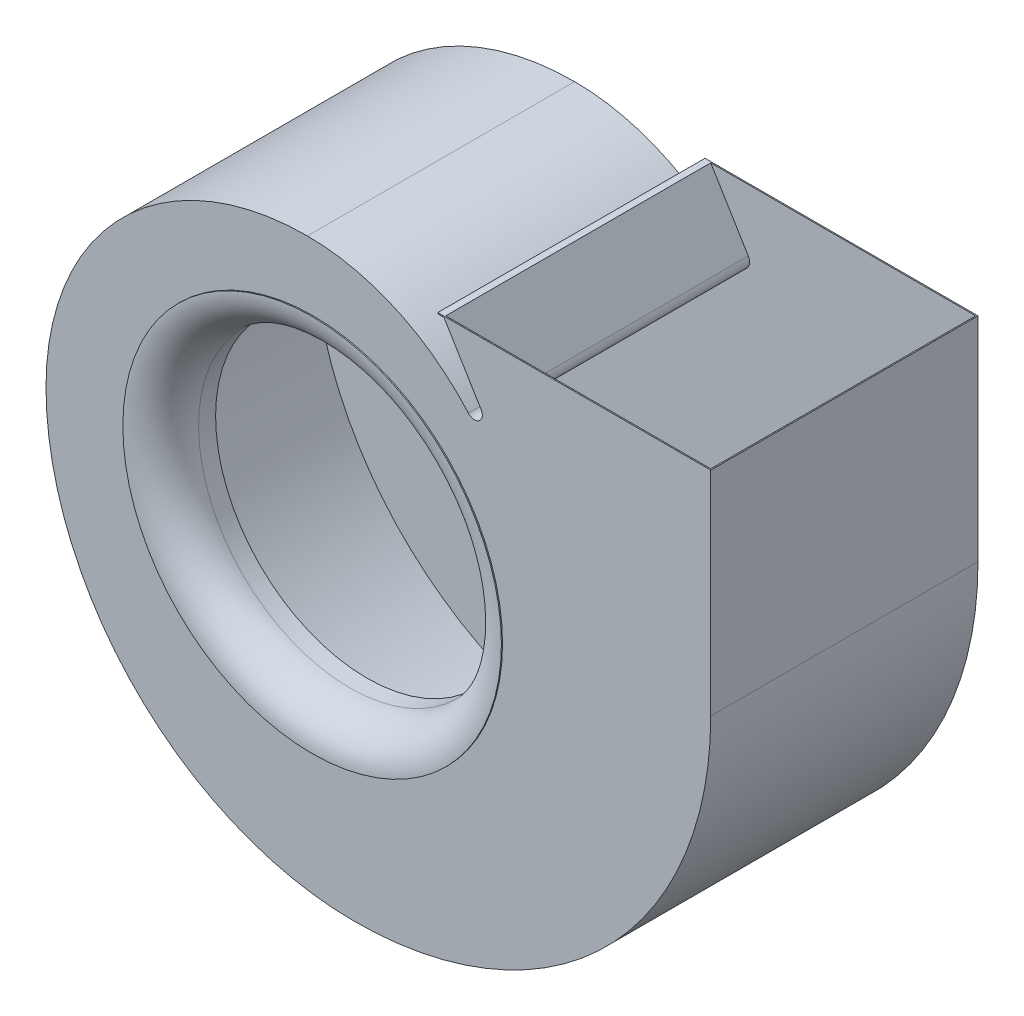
ISO-10303-21;
HEADER;
FILE_DESCRIPTION(('STEP AP214'),'2;1');
FILE_NAME('part.step','',(''),(''),'','','');
FILE_SCHEMA(('AUTOMOTIVE_DESIGN { 1 0 10303 214 1 1 1 1 }'));
ENDSEC;
DATA;
#1=APPLICATION_CONTEXT('core data for automotive mechanical design processes');
#2=APPLICATION_PROTOCOL_DEFINITION('international standard','automotive_design',2000,#1);
#3=PRODUCT_CONTEXT('',#1,'mechanical');
#4=PRODUCT('Part','Part','',(#3));
#5=PRODUCT_RELATED_PRODUCT_CATEGORY('part','',(#4));
#6=PRODUCT_DEFINITION_FORMATION('','',#4);
#7=PRODUCT_DEFINITION_CONTEXT('part definition',#1,'design');
#8=PRODUCT_DEFINITION('design','',#6,#7);
#9=PRODUCT_DEFINITION_SHAPE('','',#8);
#10=(LENGTH_UNIT() NAMED_UNIT(*) SI_UNIT(.MILLI.,.METRE.));
#11=(NAMED_UNIT(*) PLANE_ANGLE_UNIT() SI_UNIT($,.RADIAN.));
#12=(NAMED_UNIT(*) SI_UNIT($,.STERADIAN.) SOLID_ANGLE_UNIT());
#13=UNCERTAINTY_MEASURE_WITH_UNIT(LENGTH_MEASURE(1.E-05),#10,'distance_accuracy_value','');
#14=(GEOMETRIC_REPRESENTATION_CONTEXT(3) GLOBAL_UNCERTAINTY_ASSIGNED_CONTEXT((#13)) GLOBAL_UNIT_ASSIGNED_CONTEXT((#10,
#11,#12)) REPRESENTATION_CONTEXT('',''));
#15=CARTESIAN_POINT('',(0.,0.,0.));
#16=DIRECTION('',(0.,0.,1.));
#17=DIRECTION('',(1.,0.,0.));
#18=AXIS2_PLACEMENT_3D('',#15,#16,#17);
#19=CARTESIAN_POINT('',(0.,0.,326.5));
#20=DIRECTION('',(0.,0.,-1.));
#21=DIRECTION('',(0.,1.,0.));
#22=AXIS2_PLACEMENT_3D('',#19,#20,#21);
#23=TOROIDAL_SURFACE('',#22,250.,48.5);
#24=CARTESIAN_POINT('',(0.,0.,326.5));
#25=DIRECTION('',(0.,0.,-1.));
#26=DIRECTION('',(0.,1.,0.));
#27=AXIS2_PLACEMENT_3D('',#24,#25,#26);
#28=CIRCLE('',#27,201.5);
#29=CARTESIAN_POINT('',(0.,201.5,326.5));
#30=VERTEX_POINT('',#29);
#31=EDGE_CURVE('E279',#30,#30,#28,.T.);
#32=ORIENTED_EDGE('',*,*,#31,.F.);
#33=EDGE_LOOP('',(#32));
#34=FACE_BOUND('',#33,.T.);
#35=CARTESIAN_POINT('',(0.,0.,350.));
#36=DIRECTION('',(0.,0.,-1.));
#37=DIRECTION('',(-1.,0.,0.));
#38=AXIS2_PLACEMENT_3D('',#35,#36,#37);
#39=CIRCLE('',#38,207.573593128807);
#40=CARTESIAN_POINT('',(-207.573593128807,0.,350.));
#41=VERTEX_POINT('',#40);
#42=EDGE_CURVE('E11',#41,#41,#39,.F.);
#43=ORIENTED_EDGE('',*,*,#42,.F.);
#44=EDGE_LOOP('',(#43));
#45=FACE_BOUND('',#44,.T.);
#46=ADVANCED_FACE('F43',(#34,#45),#23,.F.);
#47=CARTESIAN_POINT('',(0.,0.,304.));
#48=DIRECTION('',(0.,0.,-1.));
#49=DIRECTION('',(0.,1.,0.));
#50=AXIS2_PLACEMENT_3D('',#47,#48,#49);
#51=CYLINDRICAL_SURFACE('',#50,200.);
#52=CARTESIAN_POINT('',(0.,0.,304.));
#53=DIRECTION('',(0.,0.,-1.));
#54=DIRECTION('',(0.,1.,0.));
#55=AXIS2_PLACEMENT_3D('',#52,#53,#54);
#56=CIRCLE('',#55,200.);
#57=CARTESIAN_POINT('',(0.,200.,304.));
#58=VERTEX_POINT('',#57);
#59=EDGE_CURVE('E47',#58,#58,#56,.T.);
#60=ORIENTED_EDGE('',*,*,#59,.T.);
#61=EDGE_LOOP('',(#60));
#62=FACE_BOUND('',#61,.T.);
#63=CARTESIAN_POINT('',(0.,0.,326.5));
#64=DIRECTION('',(0.,0.,-1.));
#65=DIRECTION('',(0.,1.,0.));
#66=AXIS2_PLACEMENT_3D('',#63,#64,#65);
#67=CIRCLE('',#66,200.);
#68=CARTESIAN_POINT('',(0.,200.,326.5));
#69=VERTEX_POINT('',#68);
#70=EDGE_CURVE('E269',#69,#69,#67,.T.);
#71=ORIENTED_EDGE('',*,*,#70,.F.);
#72=EDGE_LOOP('',(#71));
#73=FACE_BOUND('',#72,.T.);
#74=ADVANCED_FACE('F45',(#62,#73),#51,.F.);
#75=CARTESIAN_POINT('',(0.,201.5,304.));
#76=DIRECTION('',(0.,0.,1.));
#77=DIRECTION('',(0.,-1.,0.));
#78=AXIS2_PLACEMENT_3D('',#75,#76,#77);
#79=PLANE('',#78);
#80=ORIENTED_EDGE('',*,*,#59,.F.);
#81=EDGE_LOOP('',(#80));
#82=FACE_BOUND('',#81,.T.);
#83=CARTESIAN_POINT('',(0.,0.,304.));
#84=DIRECTION('',(0.,0.,-1.));
#85=DIRECTION('',(0.,1.,0.));
#86=AXIS2_PLACEMENT_3D('',#83,#84,#85);
#87=CIRCLE('',#86,201.5);
#88=CARTESIAN_POINT('',(0.,201.5,304.));
#89=VERTEX_POINT('',#88);
#90=EDGE_CURVE('E281',#89,#89,#87,.T.);
#91=ORIENTED_EDGE('',*,*,#90,.T.);
#92=EDGE_LOOP('',(#91));
#93=FACE_BOUND('',#92,.T.);
#94=ADVANCED_FACE('F290',(#82,#93),#79,.F.);
#95=CARTESIAN_POINT('',(0.,0.,304.));
#96=DIRECTION('',(0.,0.,-1.));
#97=DIRECTION('',(0.,1.,0.));
#98=AXIS2_PLACEMENT_3D('',#95,#96,#97);
#99=CYLINDRICAL_SURFACE('',#98,201.5);
#100=ORIENTED_EDGE('',*,*,#90,.F.);
#101=EDGE_LOOP('',(#100));
#102=FACE_BOUND('',#101,.T.);
#103=ORIENTED_EDGE('',*,*,#31,.T.);
#104=EDGE_LOOP('',(#103));
#105=FACE_BOUND('',#104,.T.);
#106=ADVANCED_FACE('F292',(#102,#105),#99,.T.);
#107=CARTESIAN_POINT('',(0.,0.,351.5));
#108=DIRECTION('',(0.,0.,-1.));
#109=DIRECTION('',(-1.,0.,0.));
#110=AXIS2_PLACEMENT_3D('',#107,#108,#109);
#111=CIRCLE('',#110,208.439802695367);
#112=CARTESIAN_POINT('',(-208.439802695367,0.,351.5));
#113=VERTEX_POINT('',#112);
#114=EDGE_CURVE('E240',#113,#113,#111,.F.);
#115=ORIENTED_EDGE('',*,*,#114,.T.);
#116=EDGE_LOOP('',(#115));
#117=FACE_BOUND('',#116,.T.);
#118=CARTESIAN_POINT('',(0.,0.,375.));
#119=DIRECTION('',(0.,0.,-1.));
#120=DIRECTION('',(0.,1.,0.));
#121=AXIS2_PLACEMENT_3D('',#118,#119,#120);
#122=CIRCLE('',#121,250.);
#123=CARTESIAN_POINT('',(0.,250.,375.));
#124=VERTEX_POINT('',#123);
#125=EDGE_CURVE('E276',#124,#124,#122,.T.);
#126=ORIENTED_EDGE('',*,*,#125,.T.);
#127=EDGE_LOOP('',(#126));
#128=FACE_BOUND('',#127,.T.);
#129=ADVANCED_FACE('F297',(#117,#128),#23,.F.);
#130=CARTESIAN_POINT('',(0.,0.,304.));
#131=DIRECTION('',(0.,0.,-1.));
#132=DIRECTION('',(0.,1.,0.));
#133=AXIS2_PLACEMENT_3D('',#130,#131,#132);
#134=CYLINDRICAL_SURFACE('',#133,250.);
#135=ORIENTED_EDGE('',*,*,#125,.F.);
#136=EDGE_LOOP('',(#135));
#137=FACE_BOUND('',#136,.T.);
#138=CARTESIAN_POINT('',(0.,0.,376.5));
#139=DIRECTION('',(0.,0.,-1.));
#140=DIRECTION('',(0.,1.,0.));
#141=AXIS2_PLACEMENT_3D('',#138,#139,#140);
#142=CIRCLE('',#141,250.);
#143=CARTESIAN_POINT('',(0.,250.,376.5));
#144=VERTEX_POINT('',#143);
#145=EDGE_CURVE('E273',#144,#144,#142,.T.);
#146=ORIENTED_EDGE('',*,*,#145,.T.);
#147=EDGE_LOOP('',(#146));
#148=FACE_BOUND('',#147,.T.);
#149=ADVANCED_FACE('F309',(#137,#148),#134,.T.);
#150=CARTESIAN_POINT('',(0.,0.,326.5));
#151=DIRECTION('',(0.,0.,-1.));
#152=DIRECTION('',(0.,1.,0.));
#153=AXIS2_PLACEMENT_3D('',#150,#151,#152);
#154=TOROIDAL_SURFACE('',#153,250.,50.);
#155=ORIENTED_EDGE('',*,*,#145,.F.);
#156=EDGE_LOOP('',(#155));
#157=FACE_BOUND('',#156,.T.);
#158=ORIENTED_EDGE('',*,*,#70,.T.);
#159=EDGE_LOOP('',(#158));
#160=FACE_BOUND('',#159,.T.);
#161=ADVANCED_FACE('F314',(#157,#160),#154,.T.);
#162=CARTESIAN_POINT('',(189.317450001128,224.5,350.));
#163=DIRECTION('',(0.,0.,1.));
#164=DIRECTION('',(1.,0.,0.));
#165=AXIS2_PLACEMENT_3D('',#162,#163,#164);
#166=PLANE('',#165);
#167=DIRECTION('',(0.,1.,0.));
#168=VECTOR('',#167,1.);
#169=CARTESIAN_POINT('',(500.,31.25,350.));
#170=LINE('',#169,#168);
#171=CARTESIAN_POINT('',(500.,31.25,350.));
#172=VERTEX_POINT('',#171);
#173=CARTESIAN_POINT('',(500.,312.5,350.));
#174=VERTEX_POINT('',#173);
#175=EDGE_CURVE('E191',#172,#174,#170,.T.);
#176=ORIENTED_EDGE('',*,*,#175,.F.);
#177=CARTESIAN_POINT('',(31.25,31.25,350.));
#178=DIRECTION('',(0.,0.,1.));
#179=DIRECTION('',(1.,0.,0.));
#180=AXIS2_PLACEMENT_3D('',#177,#178,#179);
#181=CIRCLE('',#180,468.75);
#182=CARTESIAN_POINT('',(31.2499999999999,-437.5,350.));
#183=VERTEX_POINT('',#182);
#184=EDGE_CURVE('E490',#183,#172,#181,.T.);
#185=ORIENTED_EDGE('',*,*,#184,.F.);
#186=CARTESIAN_POINT('',(31.25,-31.25,350.));
#187=DIRECTION('',(0.,0.,1.));
#188=DIRECTION('',(1.,0.,0.));
#189=AXIS2_PLACEMENT_3D('',#186,#187,#188);
#190=CIRCLE('',#189,406.25);
#191=CARTESIAN_POINT('',(-375.,-31.25,350.));
#192=VERTEX_POINT('',#191);
#193=EDGE_CURVE('E487',#192,#183,#190,.T.);
#194=ORIENTED_EDGE('',*,*,#193,.F.);
#195=CARTESIAN_POINT('',(-31.25,-31.25,350.));
#196=DIRECTION('',(0.,0.,1.));
#197=DIRECTION('',(1.,0.,0.));
#198=AXIS2_PLACEMENT_3D('',#195,#196,#197);
#199=CIRCLE('',#198,343.75);
#200=CARTESIAN_POINT('',(-31.2500000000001,312.5,350.));
#201=VERTEX_POINT('',#200);
#202=EDGE_CURVE('E483',#201,#192,#199,.T.);
#203=ORIENTED_EDGE('',*,*,#202,.F.);
#204=CARTESIAN_POINT('',(-31.25,31.25,350.));
#205=DIRECTION('',(0.,0.,1.));
#206=DIRECTION('',(1.,0.,0.));
#207=AXIS2_PLACEMENT_3D('',#204,#205,#206);
#208=CIRCLE('',#207,281.25);
#209=CARTESIAN_POINT('',(180.291671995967,216.592071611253,350.));
#210=VERTEX_POINT('',#209);
#211=EDGE_CURVE('E501',#210,#201,#208,.T.);
#212=ORIENTED_EDGE('',*,*,#211,.F.);
#213=CARTESIAN_POINT('',(189.317450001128,224.5,350.));
#214=DIRECTION('',(0.,0.,-1.));
#215=DIRECTION('',(1.,0.,0.));
#216=AXIS2_PLACEMENT_3D('',#213,#214,#215);
#217=CIRCLE('',#216,12.);
#218=CARTESIAN_POINT('',(199.578936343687,230.721084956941,350.));
#219=VERTEX_POINT('',#218);
#220=EDGE_CURVE('E438',#219,#210,#217,.T.);
#221=ORIENTED_EDGE('',*,*,#220,.F.);
#222=DIRECTION('',(0.518423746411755,-0.855123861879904,0.));
#223=VECTOR('',#222,1.);
#224=CARTESIAN_POINT('',(150.,312.5,350.));
#225=LINE('',#224,#223);
#226=CARTESIAN_POINT('',(150.,312.5,350.));
#227=VERTEX_POINT('',#226);
#228=EDGE_CURVE('E412',#227,#219,#225,.T.);
#229=ORIENTED_EDGE('',*,*,#228,.F.);
#230=DIRECTION('',(-1.,0.,0.));
#231=VECTOR('',#230,1.);
#232=CARTESIAN_POINT('',(141.,312.5,350.));
#233=LINE('',#232,#231);
#234=EDGE_CURVE('E177',#174,#227,#233,.T.);
#235=ORIENTED_EDGE('',*,*,#234,.F.);
#236=EDGE_LOOP('',(#176,#185,#194,#203,#212,#221,#229,#235));
#237=FACE_BOUND('',#236,.T.);
#238=ORIENTED_EDGE('',*,*,#42,.T.);
#239=EDGE_LOOP('',(#238));
#240=FACE_BOUND('',#239,.T.);
#241=ADVANCED_FACE('F324',(#237,#240),#166,.F.);
#242=CARTESIAN_POINT('',(189.317450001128,224.5,351.5));
#243=DIRECTION('',(0.,0.,1.));
#244=DIRECTION('',(1.,0.,0.));
#245=AXIS2_PLACEMENT_3D('',#242,#243,#244);
#246=PLANE('',#245);
#247=DIRECTION('',(1.,0.,0.));
#248=VECTOR('',#247,1.);
#249=CARTESIAN_POINT('',(141.,311.,351.5));
#250=LINE('',#249,#248);
#251=CARTESIAN_POINT('',(141.,311.,351.5));
#252=VERTEX_POINT('',#251);
#253=CARTESIAN_POINT('',(149.155251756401,311.,351.5));
#254=VERTEX_POINT('',#253);
#255=EDGE_CURVE('E241',#252,#254,#250,.T.);
#256=ORIENTED_EDGE('',*,*,#255,.T.);
#257=DIRECTION('',(0.518423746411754,-0.855123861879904,0.));
#258=VECTOR('',#257,1.);
#259=CARTESIAN_POINT('',(149.155251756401,311.,351.5));
#260=LINE('',#259,#258);
#261=CARTESIAN_POINT('',(198.296250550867,229.943449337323,351.5));
#262=VERTEX_POINT('',#261);
#263=EDGE_CURVE('E264',#254,#262,#260,.T.);
#264=ORIENTED_EDGE('',*,*,#263,.T.);
#265=CARTESIAN_POINT('',(189.317450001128,224.5,351.5));
#266=DIRECTION('',(0.,0.,-1.));
#267=DIRECTION('',(1.,0.,0.));
#268=AXIS2_PLACEMENT_3D('',#265,#266,#267);
#269=CIRCLE('',#268,10.5);
#270=CARTESIAN_POINT('',(181.419894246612,217.580562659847,351.5));
#271=VERTEX_POINT('',#270);
#272=EDGE_CURVE('E261',#262,#271,#269,.T.);
#273=ORIENTED_EDGE('',*,*,#272,.T.);
#274=CARTESIAN_POINT('',(-31.25,31.25,351.5));
#275=DIRECTION('',(0.,0.,1.));
#276=DIRECTION('',(1.,0.,0.));
#277=AXIS2_PLACEMENT_3D('',#274,#275,#276);
#278=CIRCLE('',#277,282.75);
#279=CARTESIAN_POINT('',(-31.2500000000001,314.,351.5));
#280=VERTEX_POINT('',#279);
#281=EDGE_CURVE('E258',#271,#280,#278,.T.);
#282=ORIENTED_EDGE('',*,*,#281,.T.);
#283=CARTESIAN_POINT('',(-31.25,-31.25,351.5));
#284=DIRECTION('',(0.,0.,1.));
#285=DIRECTION('',(1.,0.,0.));
#286=AXIS2_PLACEMENT_3D('',#283,#284,#285);
#287=CIRCLE('',#286,345.25);
#288=CARTESIAN_POINT('',(-376.5,-31.25,351.5));
#289=VERTEX_POINT('',#288);
#290=EDGE_CURVE('E255',#280,#289,#287,.T.);
#291=ORIENTED_EDGE('',*,*,#290,.T.);
#292=CARTESIAN_POINT('',(31.25,-31.25,351.5));
#293=DIRECTION('',(0.,0.,1.));
#294=DIRECTION('',(1.,0.,0.));
#295=AXIS2_PLACEMENT_3D('',#292,#293,#294);
#296=CIRCLE('',#295,407.75);
#297=CARTESIAN_POINT('',(31.2499999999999,-439.,351.5));
#298=VERTEX_POINT('',#297);
#299=EDGE_CURVE('E252',#289,#298,#296,.T.);
#300=ORIENTED_EDGE('',*,*,#299,.T.);
#301=CARTESIAN_POINT('',(31.25,31.25,351.5));
#302=DIRECTION('',(0.,0.,1.));
#303=DIRECTION('',(1.,0.,0.));
#304=AXIS2_PLACEMENT_3D('',#301,#302,#303);
#305=CIRCLE('',#304,470.25);
#306=CARTESIAN_POINT('',(501.5,31.25,351.5));
#307=VERTEX_POINT('',#306);
#308=EDGE_CURVE('E249',#298,#307,#305,.T.);
#309=ORIENTED_EDGE('',*,*,#308,.T.);
#310=DIRECTION('',(0.,1.,0.));
#311=VECTOR('',#310,1.);
#312=CARTESIAN_POINT('',(501.5,31.25,351.5));
#313=LINE('',#312,#311);
#314=CARTESIAN_POINT('',(501.5,312.5,351.5));
#315=VERTEX_POINT('',#314);
#316=EDGE_CURVE('E246',#307,#315,#313,.T.);
#317=ORIENTED_EDGE('',*,*,#316,.T.);
#318=DIRECTION('',(-1.,0.,0.));
#319=VECTOR('',#318,1.);
#320=CARTESIAN_POINT('',(141.,312.5,351.5));
#321=LINE('',#320,#319);
#322=CARTESIAN_POINT('',(141.,312.5,351.5));
#323=VERTEX_POINT('',#322);
#324=EDGE_CURVE('E202',#315,#323,#321,.T.);
#325=ORIENTED_EDGE('',*,*,#324,.T.);
#326=DIRECTION('',(0.,-1.,0.));
#327=VECTOR('',#326,1.);
#328=CARTESIAN_POINT('',(141.,311.,351.5));
#329=LINE('',#328,#327);
#330=EDGE_CURVE('E198',#323,#252,#329,.T.);
#331=ORIENTED_EDGE('',*,*,#330,.T.);
#332=EDGE_LOOP('',(#256,#264,#273,#282,#291,#300,#309,#317,#325,#331));
#333=FACE_BOUND('',#332,.T.);
#334=ORIENTED_EDGE('',*,*,#114,.F.);
#335=EDGE_LOOP('',(#334));
#336=FACE_BOUND('',#335,.T.);
#337=ADVANCED_FACE('F330',(#333,#336),#246,.T.);
#338=CARTESIAN_POINT('',(189.317450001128,224.5,-1.5));
#339=DIRECTION('',(0.,0.,-1.));
#340=DIRECTION('',(-1.,0.,0.));
#341=AXIS2_PLACEMENT_3D('',#338,#339,#340);
#342=PLANE('',#341);
#343=DIRECTION('',(-1.,0.,0.));
#344=VECTOR('',#343,1.);
#345=CARTESIAN_POINT('',(141.,311.,-1.5));
#346=LINE('',#345,#344);
#347=CARTESIAN_POINT('',(149.155251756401,311.,-1.5));
#348=VERTEX_POINT('',#347);
#349=CARTESIAN_POINT('',(141.,311.,-1.5));
#350=VERTEX_POINT('',#349);
#351=EDGE_CURVE('E199',#348,#350,#346,.T.);
#352=ORIENTED_EDGE('',*,*,#351,.T.);
#353=DIRECTION('',(0.,1.,0.));
#354=VECTOR('',#353,1.);
#355=CARTESIAN_POINT('',(141.,311.,-1.5));
#356=LINE('',#355,#354);
#357=CARTESIAN_POINT('',(141.,312.5,-1.5));
#358=VERTEX_POINT('',#357);
#359=EDGE_CURVE('E205',#350,#358,#356,.T.);
#360=ORIENTED_EDGE('',*,*,#359,.T.);
#361=DIRECTION('',(1.,0.,0.));
#362=VECTOR('',#361,1.);
#363=CARTESIAN_POINT('',(501.5,312.5,-1.5));
#364=LINE('',#363,#362);
#365=CARTESIAN_POINT('',(501.5,312.5,-1.5));
#366=VERTEX_POINT('',#365);
#367=EDGE_CURVE('E234',#358,#366,#364,.T.);
#368=ORIENTED_EDGE('',*,*,#367,.T.);
#369=DIRECTION('',(0.,-1.,0.));
#370=VECTOR('',#369,1.);
#371=CARTESIAN_POINT('',(501.5,31.25,-1.5));
#372=LINE('',#371,#370);
#373=CARTESIAN_POINT('',(501.5,31.25,-1.5));
#374=VERTEX_POINT('',#373);
#375=EDGE_CURVE('E231',#366,#374,#372,.T.);
#376=ORIENTED_EDGE('',*,*,#375,.T.);
#377=CARTESIAN_POINT('',(31.25,31.25,-1.5));
#378=DIRECTION('',(0.,0.,-1.));
#379=DIRECTION('',(-1.,0.,0.));
#380=AXIS2_PLACEMENT_3D('',#377,#378,#379);
#381=CIRCLE('',#380,470.25);
#382=CARTESIAN_POINT('',(31.2500000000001,-439.,-1.5));
#383=VERTEX_POINT('',#382);
#384=EDGE_CURVE('E228',#374,#383,#381,.T.);
#385=ORIENTED_EDGE('',*,*,#384,.T.);
#386=CARTESIAN_POINT('',(31.25,-31.25,-1.5));
#387=DIRECTION('',(0.,0.,-1.));
#388=DIRECTION('',(-1.,0.,0.));
#389=AXIS2_PLACEMENT_3D('',#386,#387,#388);
#390=CIRCLE('',#389,407.75);
#391=CARTESIAN_POINT('',(-376.5,-31.25,-1.5));
#392=VERTEX_POINT('',#391);
#393=EDGE_CURVE('E225',#383,#392,#390,.T.);
#394=ORIENTED_EDGE('',*,*,#393,.T.);
#395=CARTESIAN_POINT('',(-31.25,-31.25,-1.5));
#396=DIRECTION('',(0.,0.,-1.));
#397=DIRECTION('',(-1.,0.,0.));
#398=AXIS2_PLACEMENT_3D('',#395,#396,#397);
#399=CIRCLE('',#398,345.25);
#400=CARTESIAN_POINT('',(-31.25,314.,-1.5));
#401=VERTEX_POINT('',#400);
#402=EDGE_CURVE('E222',#392,#401,#399,.T.);
#403=ORIENTED_EDGE('',*,*,#402,.T.);
#404=CARTESIAN_POINT('',(-31.25,31.25,-1.5));
#405=DIRECTION('',(0.,0.,-1.));
#406=DIRECTION('',(-1.,0.,0.));
#407=AXIS2_PLACEMENT_3D('',#404,#405,#406);
#408=CIRCLE('',#407,282.75);
#409=CARTESIAN_POINT('',(181.419894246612,217.580562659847,-1.5));
#410=VERTEX_POINT('',#409);
#411=EDGE_CURVE('E219',#401,#410,#408,.T.);
#412=ORIENTED_EDGE('',*,*,#411,.T.);
#413=CARTESIAN_POINT('',(189.317450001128,224.5,-1.5));
#414=DIRECTION('',(0.,0.,1.));
#415=DIRECTION('',(-1.,0.,0.));
#416=AXIS2_PLACEMENT_3D('',#413,#414,#415);
#417=CIRCLE('',#416,10.5);
#418=CARTESIAN_POINT('',(198.296250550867,229.943449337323,-1.5));
#419=VERTEX_POINT('',#418);
#420=EDGE_CURVE('E216',#410,#419,#417,.T.);
#421=ORIENTED_EDGE('',*,*,#420,.T.);
#422=DIRECTION('',(-0.518423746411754,0.855123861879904,0.));
#423=VECTOR('',#422,1.);
#424=CARTESIAN_POINT('',(149.155251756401,311.,-1.5));
#425=LINE('',#424,#423);
#426=EDGE_CURVE('E213',#419,#348,#425,.T.);
#427=ORIENTED_EDGE('',*,*,#426,.T.);
#428=EDGE_LOOP('',(#352,#360,#368,#376,#385,#394,#403,#412,#421,#427));
#429=FACE_BOUND('',#428,.T.);
#430=ADVANCED_FACE('F335',(#429),#342,.T.);
#431=CARTESIAN_POINT('',(189.317450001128,224.5,0.));
#432=DIRECTION('',(0.,0.,-1.));
#433=DIRECTION('',(-1.,0.,0.));
#434=AXIS2_PLACEMENT_3D('',#431,#432,#433);
#435=PLANE('',#434);
#436=DIRECTION('',(1.,0.,0.));
#437=VECTOR('',#436,1.);
#438=CARTESIAN_POINT('',(501.5,312.5,0.));
#439=LINE('',#438,#437);
#440=CARTESIAN_POINT('',(150.,312.5,0.));
#441=VERTEX_POINT('',#440);
#442=CARTESIAN_POINT('',(500.,312.5,0.));
#443=VERTEX_POINT('',#442);
#444=EDGE_CURVE('E176',#441,#443,#439,.T.);
#445=ORIENTED_EDGE('',*,*,#444,.F.);
#446=DIRECTION('',(0.518423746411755,-0.855123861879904,0.));
#447=VECTOR('',#446,1.);
#448=CARTESIAN_POINT('',(150.,312.5,0.));
#449=LINE('',#448,#447);
#450=CARTESIAN_POINT('',(199.578936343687,230.721084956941,0.));
#451=VERTEX_POINT('',#450);
#452=EDGE_CURVE('E184',#441,#451,#449,.T.);
#453=ORIENTED_EDGE('',*,*,#452,.T.);
#454=CARTESIAN_POINT('',(189.317450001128,224.5,0.));
#455=DIRECTION('',(0.,0.,-1.));
#456=DIRECTION('',(1.,0.,0.));
#457=AXIS2_PLACEMENT_3D('',#454,#455,#456);
#458=CIRCLE('',#457,12.);
#459=CARTESIAN_POINT('',(180.291671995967,216.592071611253,0.));
#460=VERTEX_POINT('',#459);
#461=EDGE_CURVE('E190',#451,#460,#458,.T.);
#462=ORIENTED_EDGE('',*,*,#461,.T.);
#463=CARTESIAN_POINT('',(-31.25,31.25,0.));
#464=DIRECTION('',(0.,0.,1.));
#465=DIRECTION('',(1.,0.,0.));
#466=AXIS2_PLACEMENT_3D('',#463,#464,#465);
#467=CIRCLE('',#466,281.25);
#468=CARTESIAN_POINT('',(-31.2500000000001,312.5,0.));
#469=VERTEX_POINT('',#468);
#470=EDGE_CURVE('E425',#460,#469,#467,.T.);
#471=ORIENTED_EDGE('',*,*,#470,.T.);
#472=CARTESIAN_POINT('',(-31.25,-31.25,0.));
#473=DIRECTION('',(0.,0.,1.));
#474=DIRECTION('',(1.,0.,0.));
#475=AXIS2_PLACEMENT_3D('',#472,#473,#474);
#476=CIRCLE('',#475,343.75);
#477=CARTESIAN_POINT('',(-375.,-31.25,0.));
#478=VERTEX_POINT('',#477);
#479=EDGE_CURVE('E428',#469,#478,#476,.T.);
#480=ORIENTED_EDGE('',*,*,#479,.T.);
#481=CARTESIAN_POINT('',(31.25,-31.25,0.));
#482=DIRECTION('',(0.,0.,1.));
#483=DIRECTION('',(1.,0.,0.));
#484=AXIS2_PLACEMENT_3D('',#481,#482,#483);
#485=CIRCLE('',#484,406.25);
#486=CARTESIAN_POINT('',(31.2499999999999,-437.5,0.));
#487=VERTEX_POINT('',#486);
#488=EDGE_CURVE('E431',#478,#487,#485,.T.);
#489=ORIENTED_EDGE('',*,*,#488,.T.);
#490=CARTESIAN_POINT('',(31.25,31.25,0.));
#491=DIRECTION('',(0.,0.,1.));
#492=DIRECTION('',(1.,0.,0.));
#493=AXIS2_PLACEMENT_3D('',#490,#491,#492);
#494=CIRCLE('',#493,468.75);
#495=CARTESIAN_POINT('',(500.,31.25,0.));
#496=VERTEX_POINT('',#495);
#497=EDGE_CURVE('E434',#487,#496,#494,.T.);
#498=ORIENTED_EDGE('',*,*,#497,.T.);
#499=DIRECTION('',(0.,1.,0.));
#500=VECTOR('',#499,1.);
#501=CARTESIAN_POINT('',(500.,31.25,0.));
#502=LINE('',#501,#500);
#503=EDGE_CURVE('E197',#496,#443,#502,.T.);
#504=ORIENTED_EDGE('',*,*,#503,.T.);
#505=EDGE_LOOP('',(#445,#453,#462,#471,#480,#489,#498,#504));
#506=FACE_BOUND('',#505,.T.);
#507=ADVANCED_FACE('F194',(#506),#435,.F.);
#508=CARTESIAN_POINT('',(141.,311.,350.));
#509=DIRECTION('',(-1.,0.,0.));
#510=DIRECTION('',(0.,0.,1.));
#511=AXIS2_PLACEMENT_3D('',#508,#509,#510);
#512=PLANE('',#511);
#513=DIRECTION('',(0.,0.,-1.));
#514=VECTOR('',#513,1.);
#515=CARTESIAN_POINT('',(141.,312.5,350.));
#516=LINE('',#515,#514);
#517=EDGE_CURVE('E180',#323,#358,#516,.T.);
#518=ORIENTED_EDGE('',*,*,#517,.T.);
#519=ORIENTED_EDGE('',*,*,#359,.F.);
#520=DIRECTION('',(0.,0.,-1.));
#521=VECTOR('',#520,1.);
#522=CARTESIAN_POINT('',(141.,311.,350.));
#523=LINE('',#522,#521);
#524=EDGE_CURVE('E459',#252,#350,#523,.T.);
#525=ORIENTED_EDGE('',*,*,#524,.F.);
#526=ORIENTED_EDGE('',*,*,#330,.F.);
#527=EDGE_LOOP('',(#518,#519,#525,#526));
#528=FACE_BOUND('',#527,.T.);
#529=ADVANCED_FACE('F343',(#528),#512,.T.);
#530=CARTESIAN_POINT('',(150.,312.5,350.));
#531=DIRECTION('',(0.,1.,0.));
#532=DIRECTION('',(0.,0.,1.));
#533=AXIS2_PLACEMENT_3D('',#530,#531,#532);
#534=PLANE('',#533);
#535=ORIENTED_EDGE('',*,*,#324,.F.);
#536=DIRECTION('',(0.,0.,-1.));
#537=VECTOR('',#536,1.);
#538=CARTESIAN_POINT('',(501.5,312.5,350.));
#539=LINE('',#538,#537);
#540=EDGE_CURVE('E445',#315,#366,#539,.T.);
#541=ORIENTED_EDGE('',*,*,#540,.T.);
#542=ORIENTED_EDGE('',*,*,#367,.F.);
#543=ORIENTED_EDGE('',*,*,#517,.F.);
#544=EDGE_LOOP('',(#535,#541,#542,#543));
#545=FACE_BOUND('',#544,.T.);
#546=DIRECTION('',(0.,0.,-1.));
#547=VECTOR('',#546,1.);
#548=CARTESIAN_POINT('',(150.,312.5,350.));
#549=LINE('',#548,#547);
#550=EDGE_CURVE('E171',#227,#441,#549,.T.);
#551=ORIENTED_EDGE('',*,*,#550,.T.);
#552=ORIENTED_EDGE('',*,*,#444,.T.);
#553=DIRECTION('',(0.,0.,-1.));
#554=VECTOR('',#553,1.);
#555=CARTESIAN_POINT('',(500.,312.5,350.));
#556=LINE('',#555,#554);
#557=EDGE_CURVE('E443',#174,#443,#556,.T.);
#558=ORIENTED_EDGE('',*,*,#557,.F.);
#559=ORIENTED_EDGE('',*,*,#234,.T.);
#560=EDGE_LOOP('',(#551,#552,#558,#559));
#561=FACE_BOUND('',#560,.T.);
#562=ADVANCED_FACE('F173',(#545,#561),#534,.T.);
#563=CARTESIAN_POINT('',(150.,312.5,350.));
#564=DIRECTION('',(0.855123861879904,0.518423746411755,0.));
#565=DIRECTION('',(-0.518423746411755,0.855123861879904,0.));
#566=AXIS2_PLACEMENT_3D('',#563,#564,#565);
#567=PLANE('',#566);
#568=ORIENTED_EDGE('',*,*,#452,.F.);
#569=ORIENTED_EDGE('',*,*,#550,.F.);
#570=ORIENTED_EDGE('',*,*,#228,.T.);
#571=DIRECTION('',(0.,0.,-1.));
#572=VECTOR('',#571,1.);
#573=CARTESIAN_POINT('',(199.578936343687,230.721084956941,350.));
#574=LINE('',#573,#572);
#575=EDGE_CURVE('E181',#219,#451,#574,.T.);
#576=ORIENTED_EDGE('',*,*,#575,.T.);
#577=EDGE_LOOP('',(#568,#569,#570,#576));
#578=FACE_BOUND('',#577,.T.);
#579=ADVANCED_FACE('F185',(#578),#567,.T.);
#580=CARTESIAN_POINT('',(189.317450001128,224.5,350.));
#581=DIRECTION('',(0.,0.,-1.));
#582=DIRECTION('',(-1.,0.,0.));
#583=AXIS2_PLACEMENT_3D('',#580,#581,#582);
#584=CYLINDRICAL_SURFACE('',#583,12.);
#585=ORIENTED_EDGE('',*,*,#461,.F.);
#586=ORIENTED_EDGE('',*,*,#575,.F.);
#587=ORIENTED_EDGE('',*,*,#220,.T.);
#588=DIRECTION('',(0.,0.,-1.));
#589=VECTOR('',#588,1.);
#590=CARTESIAN_POINT('',(180.291671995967,216.592071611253,350.));
#591=LINE('',#590,#589);
#592=EDGE_CURVE('E455',#210,#460,#591,.T.);
#593=ORIENTED_EDGE('',*,*,#592,.T.);
#594=EDGE_LOOP('',(#585,#586,#587,#593));
#595=FACE_BOUND('',#594,.T.);
#596=ADVANCED_FACE('F379',(#595),#584,.T.);
#597=CARTESIAN_POINT('',(-31.25,31.25,350.));
#598=DIRECTION('',(0.,0.,-1.));
#599=DIRECTION('',(-1.,0.,0.));
#600=AXIS2_PLACEMENT_3D('',#597,#598,#599);
#601=CYLINDRICAL_SURFACE('',#600,281.25);
#602=ORIENTED_EDGE('',*,*,#470,.F.);
#603=ORIENTED_EDGE('',*,*,#592,.F.);
#604=ORIENTED_EDGE('',*,*,#211,.T.);
#605=DIRECTION('',(0.,0.,-1.));
#606=VECTOR('',#605,1.);
#607=CARTESIAN_POINT('',(-31.2500000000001,312.5,350.));
#608=LINE('',#607,#606);
#609=EDGE_CURVE('E453',#201,#469,#608,.T.);
#610=ORIENTED_EDGE('',*,*,#609,.T.);
#611=EDGE_LOOP('',(#602,#603,#604,#610));
#612=FACE_BOUND('',#611,.T.);
#613=ADVANCED_FACE('F382',(#612),#601,.F.);
#614=CARTESIAN_POINT('',(-31.25,-31.25,350.));
#615=DIRECTION('',(0.,0.,-1.));
#616=DIRECTION('',(-1.,0.,0.));
#617=AXIS2_PLACEMENT_3D('',#614,#615,#616);
#618=CYLINDRICAL_SURFACE('',#617,343.75);
#619=ORIENTED_EDGE('',*,*,#479,.F.);
#620=ORIENTED_EDGE('',*,*,#609,.F.);
#621=ORIENTED_EDGE('',*,*,#202,.T.);
#622=DIRECTION('',(0.,0.,-1.));
#623=VECTOR('',#622,1.);
#624=CARTESIAN_POINT('',(-375.,-31.25,350.));
#625=LINE('',#624,#623);
#626=EDGE_CURVE('E451',#192,#478,#625,.T.);
#627=ORIENTED_EDGE('',*,*,#626,.T.);
#628=EDGE_LOOP('',(#619,#620,#621,#627));
#629=FACE_BOUND('',#628,.T.);
#630=ADVANCED_FACE('F386',(#629),#618,.F.);
#631=CARTESIAN_POINT('',(31.25,-31.25,350.));
#632=DIRECTION('',(0.,0.,-1.));
#633=DIRECTION('',(-1.,0.,0.));
#634=AXIS2_PLACEMENT_3D('',#631,#632,#633);
#635=CYLINDRICAL_SURFACE('',#634,406.25);
#636=ORIENTED_EDGE('',*,*,#488,.F.);
#637=ORIENTED_EDGE('',*,*,#626,.F.);
#638=ORIENTED_EDGE('',*,*,#193,.T.);
#639=DIRECTION('',(0.,0.,-1.));
#640=VECTOR('',#639,1.);
#641=CARTESIAN_POINT('',(31.2499999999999,-437.5,350.));
#642=LINE('',#641,#640);
#643=EDGE_CURVE('E449',#183,#487,#642,.T.);
#644=ORIENTED_EDGE('',*,*,#643,.T.);
#645=EDGE_LOOP('',(#636,#637,#638,#644));
#646=FACE_BOUND('',#645,.T.);
#647=ADVANCED_FACE('F390',(#646),#635,.F.);
#648=CARTESIAN_POINT('',(31.25,31.25,350.));
#649=DIRECTION('',(0.,0.,-1.));
#650=DIRECTION('',(-1.,0.,0.));
#651=AXIS2_PLACEMENT_3D('',#648,#649,#650);
#652=CYLINDRICAL_SURFACE('',#651,468.75);
#653=ORIENTED_EDGE('',*,*,#497,.F.);
#654=ORIENTED_EDGE('',*,*,#643,.F.);
#655=ORIENTED_EDGE('',*,*,#184,.T.);
#656=DIRECTION('',(0.,0.,-1.));
#657=VECTOR('',#656,1.);
#658=CARTESIAN_POINT('',(500.,31.25,350.));
#659=LINE('',#658,#657);
#660=EDGE_CURVE('E447',#172,#496,#659,.T.);
#661=ORIENTED_EDGE('',*,*,#660,.T.);
#662=EDGE_LOOP('',(#653,#654,#655,#661));
#663=FACE_BOUND('',#662,.T.);
#664=ADVANCED_FACE('F394',(#663),#652,.F.);
#665=CARTESIAN_POINT('',(500.,31.25,350.));
#666=DIRECTION('',(-1.,0.,0.));
#667=DIRECTION('',(0.,0.,1.));
#668=AXIS2_PLACEMENT_3D('',#665,#666,#667);
#669=PLANE('',#668);
#670=ORIENTED_EDGE('',*,*,#503,.F.);
#671=ORIENTED_EDGE('',*,*,#660,.F.);
#672=ORIENTED_EDGE('',*,*,#175,.T.);
#673=ORIENTED_EDGE('',*,*,#557,.T.);
#674=EDGE_LOOP('',(#670,#671,#672,#673));
#675=FACE_BOUND('',#674,.T.);
#676=ADVANCED_FACE('F398',(#675),#669,.T.);
#677=CARTESIAN_POINT('',(501.5,31.25,350.));
#678=DIRECTION('',(-1.,0.,0.));
#679=DIRECTION('',(0.,0.,1.));
#680=AXIS2_PLACEMENT_3D('',#677,#678,#679);
#681=PLANE('',#680);
#682=DIRECTION('',(0.,0.,-1.));
#683=VECTOR('',#682,1.);
#684=CARTESIAN_POINT('',(501.5,31.25,350.));
#685=LINE('',#684,#683);
#686=EDGE_CURVE('E409',#307,#374,#685,.T.);
#687=ORIENTED_EDGE('',*,*,#686,.T.);
#688=ORIENTED_EDGE('',*,*,#375,.F.);
#689=ORIENTED_EDGE('',*,*,#540,.F.);
#690=ORIENTED_EDGE('',*,*,#316,.F.);
#691=EDGE_LOOP('',(#687,#688,#689,#690));
#692=FACE_BOUND('',#691,.T.);
#693=ADVANCED_FACE('F348',(#692),#681,.F.);
#694=CARTESIAN_POINT('',(31.25,31.25,350.));
#695=DIRECTION('',(0.,0.,-1.));
#696=DIRECTION('',(-1.,0.,0.));
#697=AXIS2_PLACEMENT_3D('',#694,#695,#696);
#698=CYLINDRICAL_SURFACE('',#697,470.25);
#699=DIRECTION('',(0.,0.,-1.));
#700=VECTOR('',#699,1.);
#701=CARTESIAN_POINT('',(31.2499999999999,-439.,350.));
#702=LINE('',#701,#700);
#703=EDGE_CURVE('E413',#298,#383,#702,.T.);
#704=ORIENTED_EDGE('',*,*,#703,.T.);
#705=ORIENTED_EDGE('',*,*,#384,.F.);
#706=ORIENTED_EDGE('',*,*,#686,.F.);
#707=ORIENTED_EDGE('',*,*,#308,.F.);
#708=EDGE_LOOP('',(#704,#705,#706,#707));
#709=FACE_BOUND('',#708,.T.);
#710=ADVANCED_FACE('F344',(#709),#698,.T.);
#711=CARTESIAN_POINT('',(31.25,-31.25,350.));
#712=DIRECTION('',(0.,0.,-1.));
#713=DIRECTION('',(-1.,0.,0.));
#714=AXIS2_PLACEMENT_3D('',#711,#712,#713);
#715=CYLINDRICAL_SURFACE('',#714,407.75);
#716=DIRECTION('',(0.,0.,-1.));
#717=VECTOR('',#716,1.);
#718=CARTESIAN_POINT('',(-376.5,-31.25,350.));
#719=LINE('',#718,#717);
#720=EDGE_CURVE('E418',#289,#392,#719,.T.);
#721=ORIENTED_EDGE('',*,*,#720,.T.);
#722=ORIENTED_EDGE('',*,*,#393,.F.);
#723=ORIENTED_EDGE('',*,*,#703,.F.);
#724=ORIENTED_EDGE('',*,*,#299,.F.);
#725=EDGE_LOOP('',(#721,#722,#723,#724));
#726=FACE_BOUND('',#725,.T.);
#727=ADVANCED_FACE('F347',(#726),#715,.T.);
#728=CARTESIAN_POINT('',(-31.25,-31.25,350.));
#729=DIRECTION('',(0.,0.,-1.));
#730=DIRECTION('',(-1.,0.,0.));
#731=AXIS2_PLACEMENT_3D('',#728,#729,#730);
#732=CYLINDRICAL_SURFACE('',#731,345.25);
#733=DIRECTION('',(0.,0.,-1.));
#734=VECTOR('',#733,1.);
#735=CARTESIAN_POINT('',(-31.2500000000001,314.,350.));
#736=LINE('',#735,#734);
#737=EDGE_CURVE('E420',#280,#401,#736,.T.);
#738=ORIENTED_EDGE('',*,*,#737,.T.);
#739=ORIENTED_EDGE('',*,*,#402,.F.);
#740=ORIENTED_EDGE('',*,*,#720,.F.);
#741=ORIENTED_EDGE('',*,*,#290,.F.);
#742=EDGE_LOOP('',(#738,#739,#740,#741));
#743=FACE_BOUND('',#742,.T.);
#744=ADVANCED_FACE('F352',(#743),#732,.T.);
#745=CARTESIAN_POINT('',(-31.25,31.25,350.));
#746=DIRECTION('',(0.,0.,-1.));
#747=DIRECTION('',(-1.,0.,0.));
#748=AXIS2_PLACEMENT_3D('',#745,#746,#747);
#749=CYLINDRICAL_SURFACE('',#748,282.75);
#750=DIRECTION('',(0.,0.,-1.));
#751=VECTOR('',#750,1.);
#752=CARTESIAN_POINT('',(181.419894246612,217.580562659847,350.));
#753=LINE('',#752,#751);
#754=EDGE_CURVE('E463',#271,#410,#753,.T.);
#755=ORIENTED_EDGE('',*,*,#754,.T.);
#756=ORIENTED_EDGE('',*,*,#411,.F.);
#757=ORIENTED_EDGE('',*,*,#737,.F.);
#758=ORIENTED_EDGE('',*,*,#281,.F.);
#759=EDGE_LOOP('',(#755,#756,#757,#758));
#760=FACE_BOUND('',#759,.T.);
#761=ADVANCED_FACE('F356',(#760),#749,.T.);
#762=CARTESIAN_POINT('',(189.317450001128,224.5,350.));
#763=DIRECTION('',(0.,0.,-1.));
#764=DIRECTION('',(-1.,0.,0.));
#765=AXIS2_PLACEMENT_3D('',#762,#763,#764);
#766=CYLINDRICAL_SURFACE('',#765,10.5);
#767=DIRECTION('',(0.,0.,-1.));
#768=VECTOR('',#767,1.);
#769=CARTESIAN_POINT('',(198.296250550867,229.943449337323,350.));
#770=LINE('',#769,#768);
#771=EDGE_CURVE('E66',#262,#419,#770,.T.);
#772=ORIENTED_EDGE('',*,*,#771,.T.);
#773=ORIENTED_EDGE('',*,*,#420,.F.);
#774=ORIENTED_EDGE('',*,*,#754,.F.);
#775=ORIENTED_EDGE('',*,*,#272,.F.);
#776=EDGE_LOOP('',(#772,#773,#774,#775));
#777=FACE_BOUND('',#776,.T.);
#778=ADVANCED_FACE('F360',(#777),#766,.F.);
#779=CARTESIAN_POINT('',(148.71731420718,311.722364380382,350.));
#780=DIRECTION('',(0.855123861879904,0.518423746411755,0.));
#781=DIRECTION('',(-0.518423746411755,0.855123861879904,0.));
#782=AXIS2_PLACEMENT_3D('',#779,#780,#781);
#783=PLANE('',#782);
#784=DIRECTION('',(0.,0.,-1.));
#785=VECTOR('',#784,1.);
#786=CARTESIAN_POINT('',(149.155251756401,311.,350.));
#787=LINE('',#786,#785);
#788=EDGE_CURVE('E59',#254,#348,#787,.T.);
#789=ORIENTED_EDGE('',*,*,#788,.T.);
#790=ORIENTED_EDGE('',*,*,#426,.F.);
#791=ORIENTED_EDGE('',*,*,#771,.F.);
#792=ORIENTED_EDGE('',*,*,#263,.F.);
#793=EDGE_LOOP('',(#789,#790,#791,#792));
#794=FACE_BOUND('',#793,.T.);
#795=ADVANCED_FACE('F364',(#794),#783,.F.);
#796=CARTESIAN_POINT('',(150.,311.,350.));
#797=DIRECTION('',(0.,1.,0.));
#798=DIRECTION('',(0.,0.,1.));
#799=AXIS2_PLACEMENT_3D('',#796,#797,#798);
#800=PLANE('',#799);
#801=ORIENTED_EDGE('',*,*,#524,.T.);
#802=ORIENTED_EDGE('',*,*,#351,.F.);
#803=ORIENTED_EDGE('',*,*,#788,.F.);
#804=ORIENTED_EDGE('',*,*,#255,.F.);
#805=EDGE_LOOP('',(#801,#802,#803,#804));
#806=FACE_BOUND('',#805,.T.);
#807=ADVANCED_FACE('F368',(#806),#800,.F.);
#808=CLOSED_SHELL('',(#46,#74,#94,#106,#129,#149,#161,#241,#337,#430,#507,#529,#562,#579,#596,
#613,#630,#647,#664,#676,#693,#710,#727,#744,#761,#778,#795,#807));
#809=MANIFOLD_SOLID_BREP('B2',#808);
#810=ADVANCED_BREP_SHAPE_REPRESENTATION('',(#18,#809),#14);
#811=SHAPE_DEFINITION_REPRESENTATION(#9,#810);
ENDSEC;
END-ISO-10303-21;
